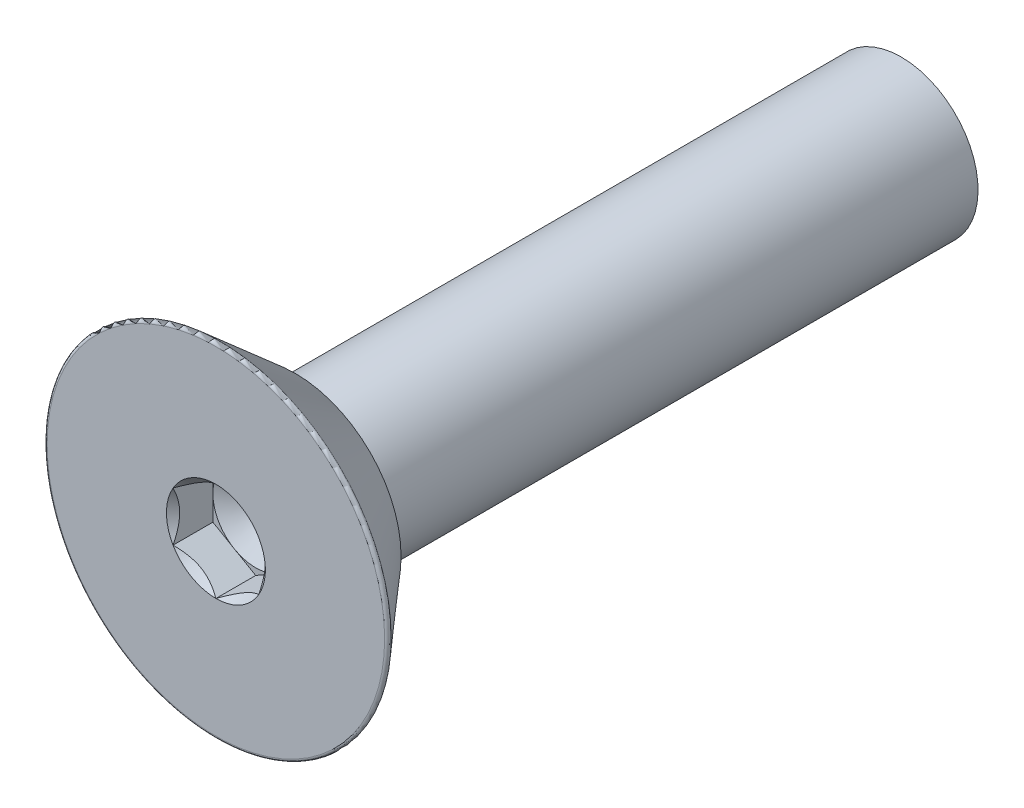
from build123d import *

# Parameters (mm, degrees)
SKETCH1_W          = 11.22426
SKETCH1_H          = 1.4224
SKETCH4_R          = 3.2385
EXTRUDE1_DEPTH     = 1.47574
FILLET1_R          = 0.0508
CUT_EXTRUDE1_DEPTH = 0.73787
SKETCH7_R          = 0.916543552
CUT_EXTRUDE4_DEPTH = 0.73787
CUT_EXTRUDE4_DRAFT = -45
SKETCH8_R          = 0.79375
CUT_EXTRUDE5_DEPTH = 0.245956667
CUT_EXTRUDE5_DRAFT = -60


with BuildPart() as part:
    # Sketch1 → Revolve1 (revolve)
    with BuildSketch(Plane(origin=(0, 0, 0), x_dir=(0, 0, -1), z_dir=(1, 0, 0))):
        with Locations((5.61213, 0.7112)):
            Rectangle(SKETCH1_W, SKETCH1_H)
    revolve(axis=Axis((0, 0, 0), (0, 0, 1)))

    # Sketch4 → Extrude1 (add)
    with BuildSketch(Plane.XY):
        Circle(SKETCH4_R)
    extrude(amount=EXTRUDE1_DEPTH)

    # Sketch9 → Cut-Revolve3 (revolve, cut)
    with BuildSketch(Plane(origin=(0, 0, 0), x_dir=(0, 0, -1), z_dir=(1, 0, 0))):
        Polygon((-1.47574, 3.2385), (0, 1.95565879), (0, 3.2385), align=None)
    revolve(axis=Axis((0, 0, 0), (0, 0, 1)), mode=Mode.SUBTRACT)

    # Fillet1
    fillet1_edges = [part.edges().sort_by_distance(p)[0] for p in [
        (0, -3.2385, 1.47574),
    ]]
    fillet(fillet1_edges, radius=FILLET1_R)

    # Sketch6 → Cut-Extrude1 (cut)
    with BuildSketch(Plane.XY.offset(1.47574)):
        Polygon((0, -0.916543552), (0.79375, -0.458271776), (0.79375, 0.458271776), (0, 0.916543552), (-0.79375, 0.458271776), (-0.79375, -0.458271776), align=None)
    extrude(amount=-CUT_EXTRUDE1_DEPTH, mode=Mode.SUBTRACT)


with BuildPart() as cut_extrude4_tool:
    # Sketch7 → Cut-Extrude4 (with draft: the straight prism first)
    with BuildSketch(Plane.XY.offset(1.47574)):
        Circle(SKETCH7_R)
    extrude(amount=-CUT_EXTRUDE4_DEPTH)
    # Cut-Extrude4: the draft: its side faces are tilted about the plane it starts from
    cut_extrude4_sides = [cut_extrude4_tool.faces().sort_by_distance(p)[0] for p in [
        (-0.916543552, 0, 1.106805),
    ]]
    draft(cut_extrude4_sides, Plane.XY.offset(1.47574), CUT_EXTRUDE4_DRAFT)


with BuildPart() as part_1:
    add(part.part)

    # Cut-Extrude4: cut by cut_extrude4_tool
    add(cut_extrude4_tool.part, mode=Mode.SUBTRACT)


with BuildPart() as cut_extrude5_tool:
    # Sketch8 → Cut-Extrude5 (with draft: the straight prism first)
    with BuildSketch(Plane.XY.offset(0.73787)):
        Circle(SKETCH8_R)
    extrude(amount=-CUT_EXTRUDE5_DEPTH)
    # Cut-Extrude5: the draft: its side faces are tilted about the plane it starts from
    cut_extrude5_sides = [cut_extrude5_tool.faces().sort_by_distance(p)[0] for p in [
        (-0.79375, 0, 0.614891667),
    ]]
    draft(cut_extrude5_sides, Plane.XY.offset(0.73787), CUT_EXTRUDE5_DRAFT)


with BuildPart() as part_2:
    add(part_1.part)

    # Cut-Extrude5: cut by cut_extrude5_tool
    add(cut_extrude5_tool.part, mode=Mode.SUBTRACT)


solid = part_2.part
